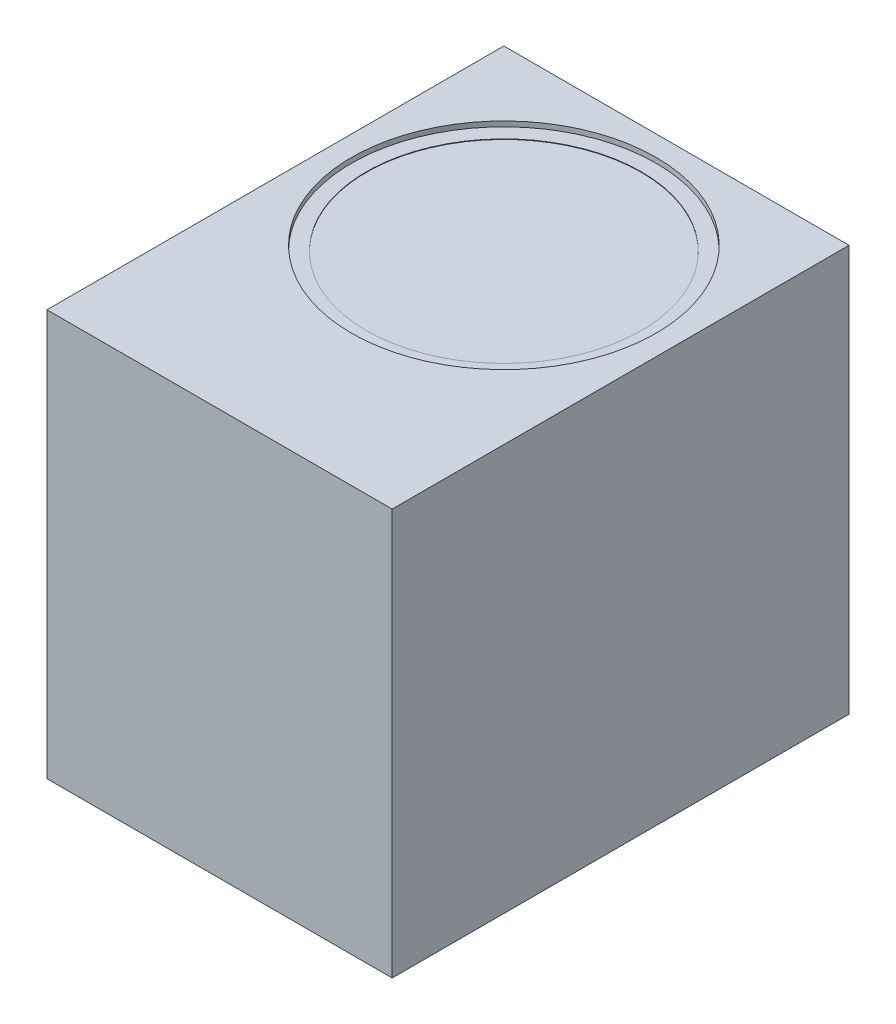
from build123d import *

# Parameters (mm, degrees)
SALIENTE_EXTRUIR1_DEPTH = 80
CROQUIS2_R              = 30
CORTAR_EXTRUIR1_DEPTH   = 1
CROQUIS3_R              = 27.091685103
CORTAR_EXTRUIR2_DEPTH   = 0.1


with BuildPart() as part:
    # Croquis1 → Saliente-Extruir1 (new body)
    with BuildSketch(Plane(origin=(0, 0, 0), x_dir=(1, 0, 0), z_dir=(0, 1, 0))):
        Polygon((-34, 0), (-34, -56), (34, -56), (34, 0), (34, 34), (-34, 34), align=None)
    extrude(amount=SALIENTE_EXTRUIR1_DEPTH)

    # Croquis2 → Cortar-Extruir1 (cut)
    with BuildSketch(Plane(origin=(0, 80, 0), x_dir=(1, 0, 0), z_dir=(0, 1, 0))):
        with Locations(Location((0, 0, 0), (0, 0, 270))):
            Circle(CROQUIS2_R)
    extrude(amount=-CORTAR_EXTRUIR1_DEPTH, mode=Mode.SUBTRACT)

    # Croquis3 → Cortar-Extruir2 (cut)
    with BuildSketch(Plane(origin=(0, 79, 0), x_dir=(1, 0, 0), z_dir=(0, 1, 0))):
        with Locations(Location((0, 0, 0), (0, 0, 270))):
            Circle(CROQUIS3_R)
    extrude(amount=-CORTAR_EXTRUIR2_DEPTH, mode=Mode.SUBTRACT)


solid = part.part
